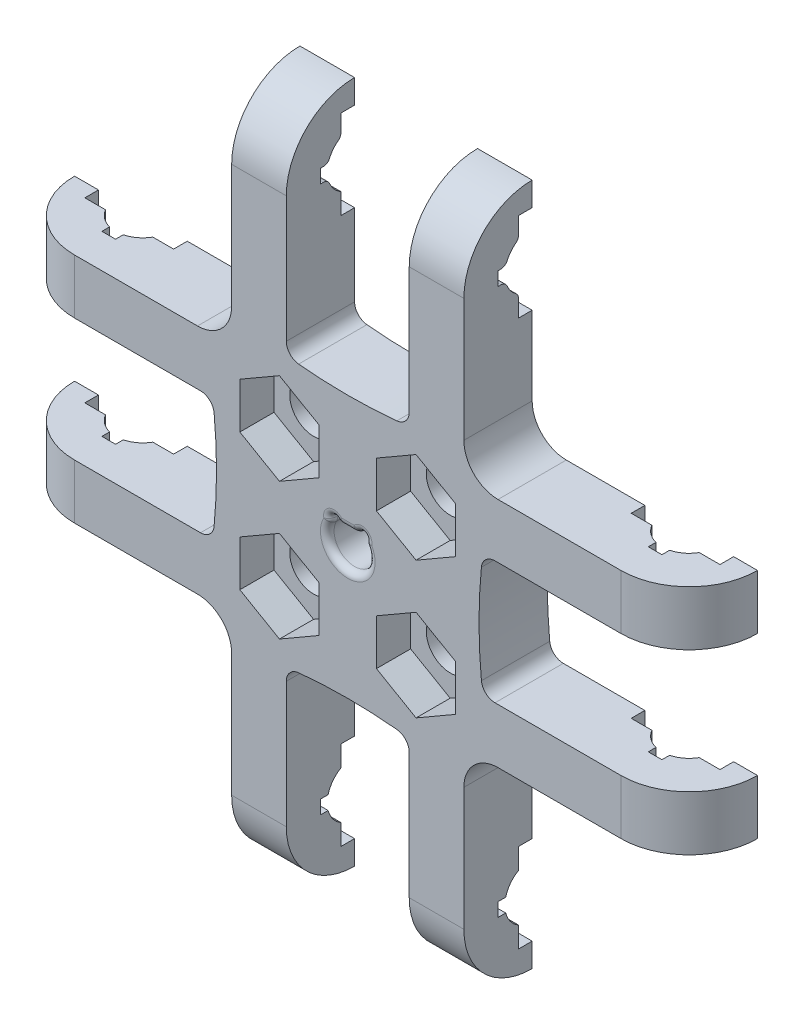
from build123d import *

# Parameters (mm, degrees)
BOSS_EXTRUDE1_DEPTH     = 10
SKETCH4_R               = 2
SKETCH4_W               = 2
SKETCH4_H               = 6.5
SKETCH4_W_2             = 5
SKETCH4_H_2             = 1
CUT_EXTRUDE3_DEPTH      = 46.885165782
SKETCH4_4_W             = 10
SKETCH4_4_H             = 0.975926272
CUT_EXTRUDE4_DEPTH      = 46.885165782
CIRPATTERN1_COUNT       = 4
FILLET1_R               = 2.5
FILLET2_R               = 1
CUT_EXTRUDE5_DEPTH      = 37.742346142
CUT_EXTRUDE5_DEPTH_BACK = 37.742346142
FILLET4_R               = 0.5
CUT_EXTRUDE6_DEPTH      = 37.742346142
CUT_EXTRUDE6_DEPTH_BACK = 37.742346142
SKETCH7_W               = 50
SKETCH7_H               = 5
CUT_EXTRUDE7_DEPTH      = 36.707142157
CUT_EXTRUDE7_DEPTH_BACK = 36.707142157
SKETCH8_R               = 1.75
SKETCH8_3_R             = 1.75
CUT_EXTRUDE8_DEPTH      = 2.5


with BuildPart() as part:
    # Sketch1 → Boss-Extrude1 (new body)
    with BuildSketch(Plane.XY):
        with BuildLine():
            ThreePointArc((8.5, 26.153393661), (6.518290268, 26.716322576), (4.5, 27.129319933))
            Line((4.5, 27.129319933), (4.5, 9.884822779))
            ThreePointArc((4.5, 9.884822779), (0, 9.60763872), (-4.5, 9.884822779))
            Line((-4.5, 9.884822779), (-4.5, 27.129319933))
            ThreePointArc((-4.5, 27.129319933), (-6.518290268, 26.716322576), (-8.5, 26.153393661))
            Line((-8.5, 26.153393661), (-8.5, 8.5))
            Line((-8.5, 8.5), (-26.153393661, 8.5))
            ThreePointArc((-26.153393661, 8.5), (-26.716322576, 6.518290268), (-27.129319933, 4.5))
            Line((-27.129319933, 4.5), (-9.884822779, 4.5))
            ThreePointArc((-9.884822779, 4.5), (-9.60763872, 0), (-9.884822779, -4.5))
            Line((-9.884822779, -4.5), (-27.129319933, -4.5))
            ThreePointArc((-27.129319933, -4.5), (-26.716322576, -6.518290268), (-26.153393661, -8.5))
            Line((-26.153393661, -8.5), (-8.5, -8.5))
            Line((-8.5, -8.5), (-8.5, -26.153393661))
            ThreePointArc((-8.5, -26.153393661), (-6.518290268, -26.716322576), (-4.5, -27.129319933))
            Line((-4.5, -27.129319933), (-4.5, -9.884822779))
            ThreePointArc((-4.5, -9.884822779), (0, -9.60763872), (4.5, -9.884822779))
            Line((4.5, -9.884822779), (4.5, -27.129319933))
            ThreePointArc((4.5, -27.129319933), (6.518290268, -26.716322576), (8.5, -26.153393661))
            Line((8.5, -26.153393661), (8.5, -8.5))
            Line((8.5, -8.5), (26.153393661, -8.5))
            ThreePointArc((26.153393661, -8.5), (26.716322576, -6.518290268), (27.129319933, -4.5))
            Line((27.129319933, -4.5), (9.884822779, -4.5))
            ThreePointArc((9.884822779, -4.5), (9.60763872, 0), (9.884822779, 4.5))
            Line((9.884822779, 4.5), (27.129319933, 4.5))
            ThreePointArc((27.129319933, 4.5), (26.716322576, 6.518290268), (26.153393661, 8.5))
            Line((26.153393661, 8.5), (8.5, 8.5))
            Line((8.5, 8.5), (8.5, 26.153393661))
        make_face()
    extrude(amount=BOSS_EXTRUDE1_DEPTH)

    # Sketch4 → Cut-Extrude3 (cut, symmetric)
    with BuildSketch(Plane(origin=(8.5, 0, 0), x_dir=(0, 0, -1), z_dir=(1, 0, 0))):
        with Locations((-5, 20)):
            Circle(SKETCH4_R)
        with Locations((-5, 20)):
            Rectangle(SKETCH4_W, SKETCH4_H)
        with Locations((-5, 20)):
            Rectangle(SKETCH4_W_2, SKETCH4_H_2)
    cut_extrude3 = extrude(amount=CUT_EXTRUDE3_DEPTH, both=True, mode=Mode.SUBTRACT)

    # Sketch4_4 → Cut-Extrude4 (cut, symmetric)
    with BuildSketch(Plane(origin=(8.5, 0, 0), x_dir=(0, 0, -1), z_dir=(1, 0, 0))):
        with BuildLine():
            ThreePointArc((-10, 20), (-5, 25), (0, 20))
            Line((0, 20), (0, 26.153393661))
            Line((0, 26.153393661), (-10, 26.153393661))
            Line((-10, 26.153393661), (-10, 20))
        make_face()
        with Locations((-5, 26.641356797)):
            Rectangle(SKETCH4_4_W, SKETCH4_4_H)
    cut_extrude4 = extrude(amount=CUT_EXTRUDE4_DEPTH, both=True, mode=Mode.SUBTRACT)

    # CirPattern1: Cut-Extrude3, Cut-Extrude4 ×4 about axis
    cirpattern1_axis = Axis((0, 0, 0), (0, 0, 1))
    add([cut_extrude3.rotate(cirpattern1_axis, i * 360 / CIRPATTERN1_COUNT) for i in range(1, CIRPATTERN1_COUNT)], mode=Mode.SUBTRACT)
    add([cut_extrude4.rotate(cirpattern1_axis, i * 360 / CIRPATTERN1_COUNT) for i in range(1, CIRPATTERN1_COUNT)], mode=Mode.SUBTRACT)

    # Fillet1
    fillet1_edges = [part.edges().sort_by_distance(p)[0] for p in [
        (8.5, 8.5, 5),
        (8.5, -8.5, 5),
        (-8.5, -8.5, 5),
        (-8.5, 8.5, 5),
    ]]
    fillet(fillet1_edges, radius=FILLET1_R)

    # Fillet2
    fillet2_edges = [part.edges().sort_by_distance(p)[0] for p in [
        (-4.5, 9.884822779, 5),
        (4.5, 9.884822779, 5),
        (9.884822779, 4.5, 5),
        (9.884822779, -4.5, 5),
        (4.5, -9.884822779, 5),
        (-4.5, -9.884822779, 5),
        (-9.884822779, -4.5, 5),
        (-9.884822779, 4.5, 5),
    ]]
    fillet(fillet2_edges, radius=FILLET2_R)

    # Sketch5 → Cut-Extrude5 (cut, two sides: drawn at the far end of the back side and taken through both)
    with BuildSketch(Plane.XY.offset(10).offset(-CUT_EXTRUDE5_DEPTH_BACK)):
        with BuildLine():
            ThreePointArc((-0.769803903, 1.1), (-1.120717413, 1.328727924), (-1.18833561, 0.915346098))
            ThreePointArc((-1.18833561, 0.915346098), (0, -1.5), (1.18833561, 0.915346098))
            ThreePointArc((1.18833561, 0.915346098), (1.120717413, 1.328727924), (0.769803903, 1.1))
            Line((0.769803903, 1.1), (-0.769803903, 1.1))
        make_face()
    extrude(amount=CUT_EXTRUDE5_DEPTH + CUT_EXTRUDE5_DEPTH_BACK, mode=Mode.SUBTRACT)

    # Fillet4
    fillet4_edges = [part.edges().sort_by_distance(p)[0] for p in [
        (1.120717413, 1.328727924, 10),
        (0, -1.5, 10),
        (-1.120717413, 1.328727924, 10),
        (1.120717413, 1.328727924, 0),
        (0.769803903, 1.1, 5),
        (0, -1.5, 0),
        (1.18833561, 0.915346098, 5),
        (-1.120717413, 1.328727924, 0),
        (-1.18833561, 0.915346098, 5),
        (0, 1.1, 0),
        (-0.769803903, 1.1, 5),
        (0, 1.1, 10),
        (-6.5, 19.5, 3.063508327),
        (6.5, 19.5, 3.063508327),
        (-6.5, 18.267949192, 4),
        (6.5, 18.267949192, 4),
        (6.5, 18.267949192, 6),
        (-6.5, 19.5, 6.936491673),
        (6.5, 19.5, 6.936491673),
        (-6.5, 20.5, 6.936491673),
        (6.5, 20.5, 6.936491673),
        (-6.5, 21.732050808, 6),
        (6.5, 21.732050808, 6),
        (-6.5, 21.732050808, 4),
        (6.5, 21.732050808, 4),
        (-6.5, 20.5, 3.063508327),
        (6.5, 20.5, 3.063508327),
    ]]
    fillet(fillet4_edges, radius=FILLET4_R)

    # Sketch7 → Cut-Extrude6 (cut, two sides: drawn at the far end of the back side and taken through both)
    with BuildSketch(Plane(origin=(0, 0, 0), x_dir=(1, 0, 0), z_dir=(0, 1, 0)).offset(-CUT_EXTRUDE6_DEPTH_BACK)):
        with Locations((0, -2.5)):
            Rectangle(SKETCH7_W, SKETCH7_H)
    extrude(amount=CUT_EXTRUDE6_DEPTH + CUT_EXTRUDE6_DEPTH_BACK, mode=Mode.SUBTRACT)

    # Sketch8 → Cut-Extrude7 (cut, two sides: drawn at the far end of the back side and taken through both)
    with BuildSketch(Plane.XY.offset(10).offset(-CUT_EXTRUDE7_DEPTH_BACK)):
        with Locations((5, -5)):
            Circle(SKETCH8_R)
        with Locations((-5, -5)):
            Circle(SKETCH8_R)
        with Locations((-5, 5)):
            Circle(SKETCH8_R)
        with Locations((5, 5)):
            Circle(SKETCH8_R)
    extrude(amount=CUT_EXTRUDE7_DEPTH + CUT_EXTRUDE7_DEPTH_BACK, mode=Mode.SUBTRACT)

    # Sketch8_3 → Cut-Extrude8 (cut)
    # profile 1 of 4: a face of its own
    with BuildSketch(Plane.XY.offset(10)):
        Polygon((-7.9, 6.674315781), (-7.9, 3.325684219), (-5, 1.651368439), (-2.1, 3.325684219), (-2.1, 6.674315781), (-5, 8.348631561), align=None)
        with Locations((-5, 5)):
            Circle(SKETCH8_3_R, mode=Mode.SUBTRACT)
    # profile 2 of 4: a face of its own
    with BuildSketch(Plane.XY.offset(10)):
        Polygon((2.1, 6.674315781), (2.1, 3.325684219), (5, 1.651368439), (7.9, 3.325684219), (7.9, 6.674315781), (5, 8.348631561), align=None)
        with Locations((5, 5)):
            Circle(SKETCH8_3_R, mode=Mode.SUBTRACT)
    # profile 3 of 4: a face of its own
    with BuildSketch(Plane.XY.offset(10)):
        Polygon((2.1, -3.325684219), (2.1, -6.674315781), (5, -8.348631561), (7.9, -6.674315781), (7.9, -3.325684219), (5, -1.651368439), align=None)
        with Locations((5, -5)):
            Circle(SKETCH8_3_R, mode=Mode.SUBTRACT)
    # profile 4 of 4: a face of its own
    with BuildSketch(Plane.XY.offset(10)):
        Polygon((-7.9, -3.325684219), (-7.9, -6.674315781), (-5, -8.348631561), (-2.1, -6.674315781), (-2.1, -3.325684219), (-5, -1.651368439), align=None)
        with Locations((-5, -5)):
            Circle(SKETCH8_3_R, mode=Mode.SUBTRACT)
    extrude(amount=-CUT_EXTRUDE8_DEPTH, mode=Mode.SUBTRACT)


solid = part.part
